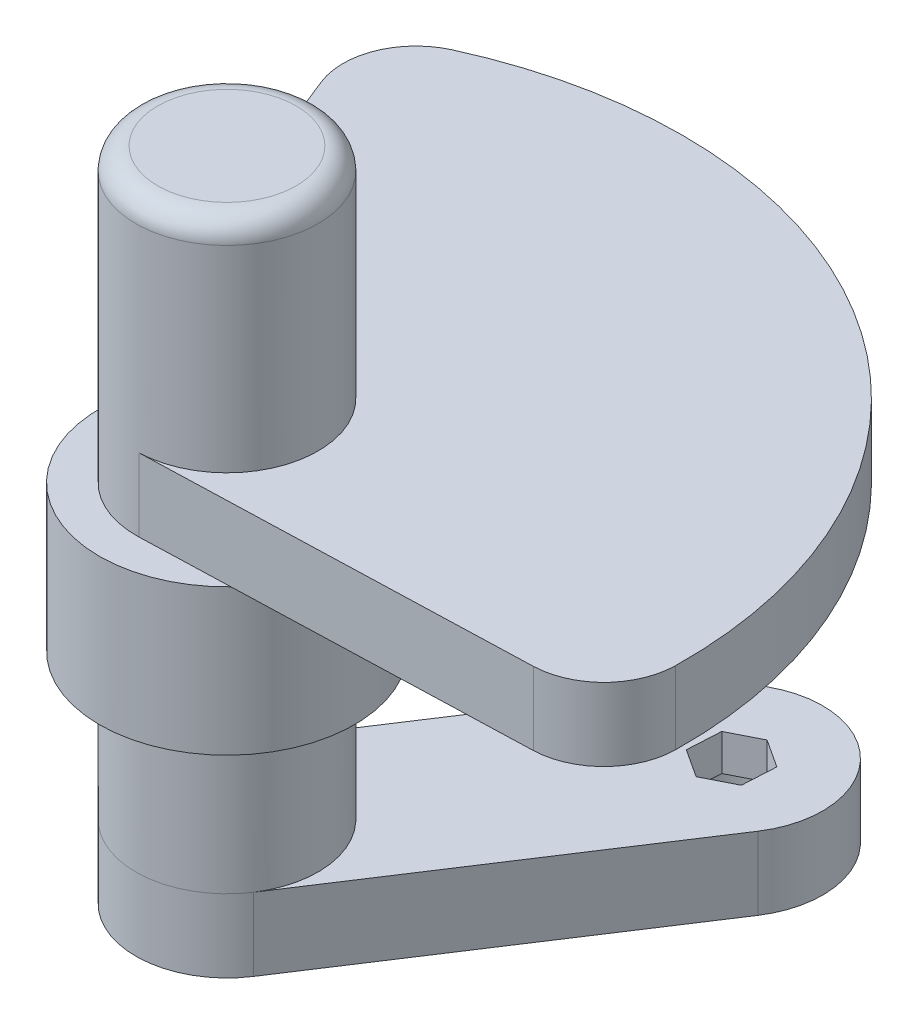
ISO-10303-21;
HEADER;
FILE_DESCRIPTION(('STEP AP214'),'2;1');
FILE_NAME('part.step','',(''),(''),'','','');
FILE_SCHEMA(('AUTOMOTIVE_DESIGN { 1 0 10303 214 1 1 1 1 }'));
ENDSEC;
DATA;
#1=APPLICATION_CONTEXT('core data for automotive mechanical design processes');
#2=APPLICATION_PROTOCOL_DEFINITION('international standard','automotive_design',2000,#1);
#3=PRODUCT_CONTEXT('',#1,'mechanical');
#4=PRODUCT('Part','Part','',(#3));
#5=PRODUCT_RELATED_PRODUCT_CATEGORY('part','',(#4));
#6=PRODUCT_DEFINITION_FORMATION('','',#4);
#7=PRODUCT_DEFINITION_CONTEXT('part definition',#1,'design');
#8=PRODUCT_DEFINITION('design','',#6,#7);
#9=PRODUCT_DEFINITION_SHAPE('','',#8);
#10=(LENGTH_UNIT() NAMED_UNIT(*) SI_UNIT(.MILLI.,.METRE.));
#11=(NAMED_UNIT(*) PLANE_ANGLE_UNIT() SI_UNIT($,.RADIAN.));
#12=(NAMED_UNIT(*) SI_UNIT($,.STERADIAN.) SOLID_ANGLE_UNIT());
#13=UNCERTAINTY_MEASURE_WITH_UNIT(LENGTH_MEASURE(1.E-05),#10,'distance_accuracy_value','');
#14=(GEOMETRIC_REPRESENTATION_CONTEXT(3) GLOBAL_UNCERTAINTY_ASSIGNED_CONTEXT((#13)) GLOBAL_UNIT_ASSIGNED_CONTEXT((#10,
#11,#12)) REPRESENTATION_CONTEXT('',''));
#15=CARTESIAN_POINT('',(0.,0.,0.));
#16=DIRECTION('',(0.,0.,1.));
#17=DIRECTION('',(1.,0.,0.));
#18=AXIS2_PLACEMENT_3D('',#15,#16,#17);
#19=CARTESIAN_POINT('',(-108.137763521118,-0.826362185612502,67.0627115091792));
#20=DIRECTION('',(0.,1.,0.));
#21=DIRECTION('',(0.546944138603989,0.,-0.837169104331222));
#22=AXIS2_PLACEMENT_3D('',#19,#20,#21);
#23=CYLINDRICAL_SURFACE('',#22,12.5);
#24=CARTESIAN_POINT('',(-108.137763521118,9.1736378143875,67.0627115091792));
#25=DIRECTION('',(0.,-1.,0.));
#26=DIRECTION('',(-0.546944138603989,0.,0.837169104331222));
#27=AXIS2_PLACEMENT_3D('',#24,#25,#26);
#28=CIRCLE('',#27,12.5);
#29=CARTESIAN_POINT('',(-97.6731497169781,9.1736378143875,73.8995132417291));
#30=VERTEX_POINT('',#29);
#31=CARTESIAN_POINT('',(-118.602377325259,9.1736378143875,60.2259097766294));
#32=VERTEX_POINT('',#31);
#33=EDGE_CURVE('P0_E153',#30,#32,#28,.T.);
#34=ORIENTED_EDGE('',*,*,#33,.T.);
#35=DIRECTION('',(0.,1.,0.));
#36=VECTOR('',#35,1.);
#37=CARTESIAN_POINT('',(-118.602377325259,-0.826362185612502,60.2259097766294));
#38=LINE('',#37,#36);
#39=CARTESIAN_POINT('',(-118.602377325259,-0.826362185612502,60.2259097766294));
#40=VERTEX_POINT('',#39);
#41=EDGE_CURVE('P0_E202',#40,#32,#38,.T.);
#42=ORIENTED_EDGE('',*,*,#41,.F.);
#43=CARTESIAN_POINT('',(-108.137763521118,-0.826362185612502,67.0627115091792));
#44=DIRECTION('',(0.,-1.,0.));
#45=DIRECTION('',(-0.546944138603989,0.,0.837169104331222));
#46=AXIS2_PLACEMENT_3D('',#43,#44,#45);
#47=CIRCLE('',#46,12.5);
#48=CARTESIAN_POINT('',(-97.6731497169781,-0.826362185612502,73.8995132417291));
#49=VERTEX_POINT('',#48);
#50=EDGE_CURVE('P0_E176',#49,#40,#47,.T.);
#51=ORIENTED_EDGE('',*,*,#50,.F.);
#52=DIRECTION('',(0.,1.,0.));
#53=VECTOR('',#52,1.);
#54=CARTESIAN_POINT('',(-97.6731497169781,-0.826362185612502,73.8995132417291));
#55=LINE('',#54,#53);
#56=EDGE_CURVE('P0_E186',#49,#30,#55,.T.);
#57=ORIENTED_EDGE('',*,*,#56,.T.);
#58=EDGE_LOOP('',(#34,#42,#51,#57));
#59=FACE_BOUND('',#58,.T.);
#60=ADVANCED_FACE('P0_F16',(#59),#23,.T.);
#61=CARTESIAN_POINT('',(-118.602377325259,-0.826362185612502,60.2259097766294));
#62=DIRECTION('',(0.837169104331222,0.,0.546944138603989));
#63=DIRECTION('',(-0.546944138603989,0.,0.837169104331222));
#64=AXIS2_PLACEMENT_3D('',#61,#62,#63);
#65=PLANE('',#64);
#66=DIRECTION('',(0.546944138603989,0.,-0.837169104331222));
#67=VECTOR('',#66,1.);
#68=CARTESIAN_POINT('',(-118.602377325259,9.1736378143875,60.2259097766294));
#69=LINE('',#68,#67);
#70=CARTESIAN_POINT('',(-91.2551703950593,9.1736378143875,18.3674545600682));
#71=VERTEX_POINT('',#70);
#72=EDGE_CURVE('P0_E189',#32,#71,#69,.T.);
#73=ORIENTED_EDGE('',*,*,#72,.T.);
#74=DIRECTION('',(0.,1.,0.));
#75=VECTOR('',#74,1.);
#76=CARTESIAN_POINT('',(-91.2551703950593,-0.826362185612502,18.3674545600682));
#77=LINE('',#76,#75);
#78=CARTESIAN_POINT('',(-91.2551703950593,-0.826362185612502,18.3674545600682));
#79=VERTEX_POINT('',#78);
#80=EDGE_CURVE('P0_E199',#79,#71,#77,.T.);
#81=ORIENTED_EDGE('',*,*,#80,.F.);
#82=DIRECTION('',(0.546944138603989,0.,-0.837169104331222));
#83=VECTOR('',#82,1.);
#84=CARTESIAN_POINT('',(-118.602377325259,-0.826362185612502,60.2259097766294));
#85=LINE('',#84,#83);
#86=EDGE_CURVE('P0_E179',#40,#79,#85,.T.);
#87=ORIENTED_EDGE('',*,*,#86,.F.);
#88=ORIENTED_EDGE('',*,*,#41,.T.);
#89=EDGE_LOOP('',(#73,#81,#87,#88));
#90=FACE_BOUND('',#89,.T.);
#91=ADVANCED_FACE('P0_F250',(#90),#65,.F.);
#92=CARTESIAN_POINT('',(-80.790556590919,-0.826362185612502,25.2042562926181));
#93=DIRECTION('',(0.,1.,0.));
#94=DIRECTION('',(0.546944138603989,0.,-0.837169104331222));
#95=AXIS2_PLACEMENT_3D('',#92,#93,#94);
#96=CYLINDRICAL_SURFACE('',#95,12.5);
#97=CARTESIAN_POINT('',(-80.790556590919,9.1736378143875,25.2042562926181));
#98=DIRECTION('',(0.,-1.,0.));
#99=DIRECTION('',(-0.546944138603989,0.,0.837169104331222));
#100=AXIS2_PLACEMENT_3D('',#97,#98,#99);
#101=CIRCLE('',#100,12.5);
#102=CARTESIAN_POINT('',(-70.3259427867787,9.1736378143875,32.0410580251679));
#103=VERTEX_POINT('',#102);
#104=EDGE_CURVE('P0_E191',#71,#103,#101,.T.);
#105=ORIENTED_EDGE('',*,*,#104,.T.);
#106=DIRECTION('',(0.,1.,0.));
#107=VECTOR('',#106,1.);
#108=CARTESIAN_POINT('',(-70.3259427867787,-0.826362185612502,32.0410580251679));
#109=LINE('',#108,#107);
#110=CARTESIAN_POINT('',(-70.3259427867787,-0.826362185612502,32.0410580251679));
#111=VERTEX_POINT('',#110);
#112=EDGE_CURVE('P0_E196',#111,#103,#109,.T.);
#113=ORIENTED_EDGE('',*,*,#112,.F.);
#114=CARTESIAN_POINT('',(-80.790556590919,-0.826362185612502,25.2042562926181));
#115=DIRECTION('',(0.,-1.,0.));
#116=DIRECTION('',(-0.546944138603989,0.,0.837169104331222));
#117=AXIS2_PLACEMENT_3D('',#114,#115,#116);
#118=CIRCLE('',#117,12.5);
#119=EDGE_CURVE('P0_E182',#79,#111,#118,.T.);
#120=ORIENTED_EDGE('',*,*,#119,.F.);
#121=ORIENTED_EDGE('',*,*,#80,.T.);
#122=EDGE_LOOP('',(#105,#113,#120,#121));
#123=FACE_BOUND('',#122,.T.);
#124=ADVANCED_FACE('P0_F255',(#123),#96,.T.);
#125=CARTESIAN_POINT('',(-97.6731497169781,-0.826362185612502,73.8995132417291));
#126=DIRECTION('',(-0.837169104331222,0.,-0.546944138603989));
#127=DIRECTION('',(0.546944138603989,0.,-0.837169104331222));
#128=AXIS2_PLACEMENT_3D('',#125,#126,#127);
#129=PLANE('',#128);
#130=DIRECTION('',(-0.546944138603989,0.,0.837169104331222));
#131=VECTOR('',#130,1.);
#132=CARTESIAN_POINT('',(-97.6731497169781,9.1736378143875,73.8995132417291));
#133=LINE('',#132,#131);
#134=EDGE_CURVE('P0_E180',#103,#30,#133,.T.);
#135=ORIENTED_EDGE('',*,*,#134,.T.);
#136=ORIENTED_EDGE('',*,*,#56,.F.);
#137=DIRECTION('',(-0.546944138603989,0.,0.837169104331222));
#138=VECTOR('',#137,1.);
#139=CARTESIAN_POINT('',(-97.6731497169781,-0.826362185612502,73.8995132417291));
#140=LINE('',#139,#138);
#141=EDGE_CURVE('P0_E184',#111,#49,#140,.T.);
#142=ORIENTED_EDGE('',*,*,#141,.F.);
#143=ORIENTED_EDGE('',*,*,#112,.T.);
#144=EDGE_LOOP('',(#135,#136,#142,#143));
#145=FACE_BOUND('',#144,.T.);
#146=ADVANCED_FACE('P0_F271',(#145),#129,.F.);
#147=CARTESIAN_POINT('',(-108.137763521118,-0.826362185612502,67.0627115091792));
#148=DIRECTION('',(0.,-1.,0.));
#149=DIRECTION('',(-0.546944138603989,0.,0.837169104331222));
#150=AXIS2_PLACEMENT_3D('',#147,#148,#149);
#151=PLANE('',#150);
#152=CARTESIAN_POINT('',(-80.790556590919,-0.826362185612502,25.2042562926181));
#153=DIRECTION('',(0.,1.,0.));
#154=DIRECTION('',(0.546944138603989,0.,-0.837169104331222));
#155=AXIS2_PLACEMENT_3D('',#152,#153,#154);
#156=CIRCLE('',#155,8.);
#157=CARTESIAN_POINT('',(-76.4150034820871,-0.826362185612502,18.5069034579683));
#158=VERTEX_POINT('',#157);
#159=EDGE_CURVE('P0_E125',#158,#158,#156,.T.);
#160=ORIENTED_EDGE('',*,*,#159,.T.);
#161=EDGE_LOOP('',(#160));
#162=FACE_BOUND('',#161,.T.);
#163=CARTESIAN_POINT('',(-103.215266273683,-0.826362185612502,59.5281895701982));
#164=DIRECTION('',(0.,-1.,0.));
#165=DIRECTION('',(-0.546944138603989,0.,0.837169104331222));
#166=AXIS2_PLACEMENT_3D('',#163,#164,#165);
#167=CIRCLE('',#166,2.85);
#168=CARTESIAN_POINT('',(-104.774057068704,-0.826362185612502,61.9141215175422));
#169=VERTEX_POINT('',#168);
#170=EDGE_CURVE('P0_E154',#169,#169,#167,.T.);
#171=ORIENTED_EDGE('',*,*,#170,.F.);
#172=EDGE_LOOP('',(#171));
#173=FACE_BOUND('',#172,.T.);
#174=CARTESIAN_POINT('',(-115.672285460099,-0.826362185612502,62.1402142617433));
#175=DIRECTION('',(0.,-1.,0.));
#176=DIRECTION('',(-0.546944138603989,0.,0.837169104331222));
#177=AXIS2_PLACEMENT_3D('',#174,#175,#176);
#178=CIRCLE('',#177,2.85);
#179=CARTESIAN_POINT('',(-117.231076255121,-0.826362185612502,64.5261462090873));
#180=VERTEX_POINT('',#179);
#181=EDGE_CURVE('P0_E160',#180,#180,#178,.T.);
#182=ORIENTED_EDGE('',*,*,#181,.F.);
#183=EDGE_LOOP('',(#182));
#184=FACE_BOUND('',#183,.T.);
#185=CARTESIAN_POINT('',(-113.060260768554,-0.826362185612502,74.5972334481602));
#186=DIRECTION('',(0.,-1.,0.));
#187=DIRECTION('',(-0.546944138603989,0.,0.837169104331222));
#188=AXIS2_PLACEMENT_3D('',#185,#186,#187);
#189=CIRCLE('',#188,2.85);
#190=CARTESIAN_POINT('',(-114.619051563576,-0.826362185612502,76.9831653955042));
#191=VERTEX_POINT('',#190);
#192=EDGE_CURVE('P0_E166',#191,#191,#189,.T.);
#193=ORIENTED_EDGE('',*,*,#192,.F.);
#194=EDGE_LOOP('',(#193));
#195=FACE_BOUND('',#194,.T.);
#196=CARTESIAN_POINT('',(-100.603241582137,-0.826362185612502,71.9852087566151));
#197=DIRECTION('',(0.,-1.,0.));
#198=DIRECTION('',(-0.546944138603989,0.,0.837169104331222));
#199=AXIS2_PLACEMENT_3D('',#196,#197,#198);
#200=CIRCLE('',#199,2.85);
#201=CARTESIAN_POINT('',(-102.162032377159,-0.826362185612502,74.3711407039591));
#202=VERTEX_POINT('',#201);
#203=EDGE_CURVE('P0_E172',#202,#202,#200,.T.);
#204=ORIENTED_EDGE('',*,*,#203,.F.);
#205=EDGE_LOOP('',(#204));
#206=FACE_BOUND('',#205,.T.);
#207=ORIENTED_EDGE('',*,*,#50,.T.);
#208=ORIENTED_EDGE('',*,*,#86,.T.);
#209=ORIENTED_EDGE('',*,*,#119,.T.);
#210=ORIENTED_EDGE('',*,*,#141,.T.);
#211=EDGE_LOOP('',(#207,#208,#209,#210));
#212=FACE_BOUND('',#211,.T.);
#213=ADVANCED_FACE('P0_F267',(#162,#173,#184,#195,#206,#212),#151,.T.);
#214=CARTESIAN_POINT('',(-108.137763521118,9.1736378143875,67.0627115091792));
#215=DIRECTION('',(0.,-1.,0.));
#216=DIRECTION('',(-0.546944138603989,0.,0.837169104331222));
#217=AXIS2_PLACEMENT_3D('',#214,#215,#216);
#218=PLANE('',#217);
#219=DIRECTION('',(-0.0550829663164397,0.,0.998481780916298));
#220=VECTOR('',#219,1.);
#221=CARTESIAN_POINT('',(-84.6572750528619,9.1736378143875,22.6780295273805));
#222=LINE('',#221,#220);
#223=CARTESIAN_POINT('',(-84.6572750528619,9.1736378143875,22.6780295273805));
#224=VERTEX_POINT('',#223);
#225=CARTESIAN_POINT('',(-84.9116923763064,9.1736378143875,27.2898193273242));
#226=VERTEX_POINT('',#225);
#227=EDGE_CURVE('P0_E104',#224,#226,#222,.T.);
#228=ORIENTED_EDGE('',*,*,#227,.F.);
#229=DIRECTION('',(-0.892252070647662,0.,0.45153764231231));
#230=VECTOR('',#229,1.);
#231=CARTESIAN_POINT('',(-80.5361392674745,9.1736378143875,20.5924664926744));
#232=LINE('',#231,#230);
#233=CARTESIAN_POINT('',(-80.5361392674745,9.1736378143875,20.5924664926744));
#234=VERTEX_POINT('',#233);
#235=EDGE_CURVE('P0_E30',#234,#224,#232,.T.);
#236=ORIENTED_EDGE('',*,*,#235,.F.);
#237=DIRECTION('',(-0.837169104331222,0.,-0.546944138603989));
#238=VECTOR('',#237,1.);
#239=CARTESIAN_POINT('',(-76.6694208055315,9.1736378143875,23.118693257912));
#240=LINE('',#239,#238);
#241=CARTESIAN_POINT('',(-76.6694208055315,9.1736378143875,23.118693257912));
#242=VERTEX_POINT('',#241);
#243=EDGE_CURVE('P0_E120',#242,#234,#240,.T.);
#244=ORIENTED_EDGE('',*,*,#243,.F.);
#245=DIRECTION('',(0.0550829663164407,0.,-0.998481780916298));
#246=VECTOR('',#245,1.);
#247=CARTESIAN_POINT('',(-76.923838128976,9.1736378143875,27.7304830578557));
#248=LINE('',#247,#246);
#249=CARTESIAN_POINT('',(-76.923838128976,9.1736378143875,27.7304830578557));
#250=VERTEX_POINT('',#249);
#251=EDGE_CURVE('P0_E114',#250,#242,#248,.T.);
#252=ORIENTED_EDGE('',*,*,#251,.F.);
#253=DIRECTION('',(0.892252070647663,0.,-0.451537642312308));
#254=VECTOR('',#253,1.);
#255=CARTESIAN_POINT('',(-81.0449739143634,9.1736378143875,29.8160460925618));
#256=LINE('',#255,#254);
#257=CARTESIAN_POINT('',(-81.0449739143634,9.1736378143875,29.8160460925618));
#258=VERTEX_POINT('',#257);
#259=EDGE_CURVE('P0_E112',#258,#250,#256,.T.);
#260=ORIENTED_EDGE('',*,*,#259,.F.);
#261=DIRECTION('',(0.837169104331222,0.,0.546944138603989));
#262=VECTOR('',#261,1.);
#263=CARTESIAN_POINT('',(-84.9116923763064,9.1736378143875,27.2898193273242));
#264=LINE('',#263,#262);
#265=EDGE_CURVE('P0_E95',#226,#258,#264,.T.);
#266=ORIENTED_EDGE('',*,*,#265,.F.);
#267=EDGE_LOOP('',(#228,#236,#244,#252,#260,#266));
#268=FACE_BOUND('',#267,.T.);
#269=CARTESIAN_POINT('',(-103.215266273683,9.1736378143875,59.5281895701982));
#270=DIRECTION('',(0.,-1.,0.));
#271=DIRECTION('',(-0.546944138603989,0.,0.837169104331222));
#272=AXIS2_PLACEMENT_3D('',#269,#270,#271);
#273=CIRCLE('',#272,2.);
#274=CARTESIAN_POINT('',(-104.30915455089,9.1736378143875,61.2025277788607));
#275=VERTEX_POINT('',#274);
#276=EDGE_CURVE('P0_E138',#275,#275,#273,.T.);
#277=ORIENTED_EDGE('',*,*,#276,.T.);
#278=EDGE_LOOP('',(#277));
#279=FACE_BOUND('',#278,.T.);
#280=CARTESIAN_POINT('',(-115.672285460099,9.1736378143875,62.1402142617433));
#281=DIRECTION('',(0.,-1.,0.));
#282=DIRECTION('',(-0.546944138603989,0.,0.837169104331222));
#283=AXIS2_PLACEMENT_3D('',#280,#281,#282);
#284=CIRCLE('',#283,2.);
#285=CARTESIAN_POINT('',(-116.766173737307,9.1736378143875,63.8145524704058));
#286=VERTEX_POINT('',#285);
#287=EDGE_CURVE('P0_E142',#286,#286,#284,.T.);
#288=ORIENTED_EDGE('',*,*,#287,.T.);
#289=EDGE_LOOP('',(#288));
#290=FACE_BOUND('',#289,.T.);
#291=CARTESIAN_POINT('',(-113.060260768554,9.1736378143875,74.5972334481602));
#292=DIRECTION('',(0.,-1.,0.));
#293=DIRECTION('',(-0.546944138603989,0.,0.837169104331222));
#294=AXIS2_PLACEMENT_3D('',#291,#292,#293);
#295=CIRCLE('',#294,2.);
#296=CARTESIAN_POINT('',(-114.154149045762,9.1736378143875,76.2715716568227));
#297=VERTEX_POINT('',#296);
#298=EDGE_CURVE('P0_E145',#297,#297,#295,.T.);
#299=ORIENTED_EDGE('',*,*,#298,.T.);
#300=EDGE_LOOP('',(#299));
#301=FACE_BOUND('',#300,.T.);
#302=CARTESIAN_POINT('',(-100.603241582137,9.1736378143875,71.9852087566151));
#303=DIRECTION('',(0.,-1.,0.));
#304=DIRECTION('',(-0.546944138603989,0.,0.837169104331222));
#305=AXIS2_PLACEMENT_3D('',#302,#303,#304);
#306=CIRCLE('',#305,2.);
#307=CARTESIAN_POINT('',(-101.697129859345,9.1736378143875,73.6595469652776));
#308=VERTEX_POINT('',#307);
#309=EDGE_CURVE('P0_E135',#308,#308,#306,.T.);
#310=ORIENTED_EDGE('',*,*,#309,.T.);
#311=EDGE_LOOP('',(#310));
#312=FACE_BOUND('',#311,.T.);
#313=ORIENTED_EDGE('',*,*,#33,.F.);
#314=ORIENTED_EDGE('',*,*,#134,.F.);
#315=ORIENTED_EDGE('',*,*,#104,.F.);
#316=ORIENTED_EDGE('',*,*,#72,.F.);
#317=EDGE_LOOP('',(#313,#314,#315,#316));
#318=FACE_BOUND('',#317,.T.);
#319=ADVANCED_FACE('P0_F108',(#268,#279,#290,#301,#312,#318),#218,.F.);
#320=CARTESIAN_POINT('',(-100.603241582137,2.1736378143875,71.9852087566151));
#321=DIRECTION('',(0.,-1.,0.));
#322=DIRECTION('',(-0.546944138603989,0.,0.837169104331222));
#323=AXIS2_PLACEMENT_3D('',#320,#321,#322);
#324=CYLINDRICAL_SURFACE('',#323,2.85);
#325=CARTESIAN_POINT('',(-100.603241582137,2.1736378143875,71.9852087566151));
#326=DIRECTION('',(0.,-1.,0.));
#327=DIRECTION('',(-0.546944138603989,0.,0.837169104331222));
#328=AXIS2_PLACEMENT_3D('',#325,#326,#327);
#329=CIRCLE('',#328,2.85);
#330=CARTESIAN_POINT('',(-102.162032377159,2.1736378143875,74.3711407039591));
#331=VERTEX_POINT('',#330);
#332=EDGE_CURVE('P0_E169',#331,#331,#329,.T.);
#333=ORIENTED_EDGE('',*,*,#332,.F.);
#334=EDGE_LOOP('',(#333));
#335=FACE_BOUND('',#334,.T.);
#336=ORIENTED_EDGE('',*,*,#203,.T.);
#337=EDGE_LOOP('',(#336));
#338=FACE_BOUND('',#337,.T.);
#339=ADVANCED_FACE('P0_F282',(#335,#338),#324,.F.);
#340=CARTESIAN_POINT('',(-100.603241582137,2.1736378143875,71.9852087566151));
#341=DIRECTION('',(0.,-1.,0.));
#342=DIRECTION('',(-0.546944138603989,0.,0.837169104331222));
#343=AXIS2_PLACEMENT_3D('',#340,#341,#342);
#344=PLANE('',#343);
#345=CARTESIAN_POINT('',(-100.603241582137,2.1736378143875,71.9852087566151));
#346=DIRECTION('',(0.,-1.,0.));
#347=DIRECTION('',(-0.546944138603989,0.,0.837169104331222));
#348=AXIS2_PLACEMENT_3D('',#345,#346,#347);
#349=CIRCLE('',#348,2.);
#350=CARTESIAN_POINT('',(-101.697129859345,2.1736378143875,73.6595469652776));
#351=VERTEX_POINT('',#350);
#352=EDGE_CURVE('P0_E175',#351,#351,#349,.T.);
#353=ORIENTED_EDGE('',*,*,#352,.F.);
#354=EDGE_LOOP('',(#353));
#355=FACE_BOUND('',#354,.T.);
#356=ORIENTED_EDGE('',*,*,#332,.T.);
#357=EDGE_LOOP('',(#356));
#358=FACE_BOUND('',#357,.T.);
#359=ADVANCED_FACE('P0_F288',(#355,#358),#344,.T.);
#360=CARTESIAN_POINT('',(-113.060260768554,2.1736378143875,74.5972334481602));
#361=DIRECTION('',(0.,-1.,0.));
#362=DIRECTION('',(-0.546944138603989,0.,0.837169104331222));
#363=AXIS2_PLACEMENT_3D('',#360,#361,#362);
#364=CYLINDRICAL_SURFACE('',#363,2.85);
#365=CARTESIAN_POINT('',(-113.060260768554,2.1736378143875,74.5972334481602));
#366=DIRECTION('',(0.,-1.,0.));
#367=DIRECTION('',(-0.546944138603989,0.,0.837169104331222));
#368=AXIS2_PLACEMENT_3D('',#365,#366,#367);
#369=CIRCLE('',#368,2.85);
#370=CARTESIAN_POINT('',(-114.619051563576,2.1736378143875,76.9831653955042));
#371=VERTEX_POINT('',#370);
#372=EDGE_CURVE('P0_E163',#371,#371,#369,.T.);
#373=ORIENTED_EDGE('',*,*,#372,.F.);
#374=EDGE_LOOP('',(#373));
#375=FACE_BOUND('',#374,.T.);
#376=ORIENTED_EDGE('',*,*,#192,.T.);
#377=EDGE_LOOP('',(#376));
#378=FACE_BOUND('',#377,.T.);
#379=ADVANCED_FACE('P0_F292',(#375,#378),#364,.F.);
#380=CARTESIAN_POINT('',(-113.060260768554,2.1736378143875,74.5972334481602));
#381=DIRECTION('',(0.,-1.,0.));
#382=DIRECTION('',(-0.546944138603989,0.,0.837169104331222));
#383=AXIS2_PLACEMENT_3D('',#380,#381,#382);
#384=PLANE('',#383);
#385=CARTESIAN_POINT('',(-113.060260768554,2.1736378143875,74.5972334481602));
#386=DIRECTION('',(0.,-1.,0.));
#387=DIRECTION('',(-0.546944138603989,0.,0.837169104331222));
#388=AXIS2_PLACEMENT_3D('',#385,#386,#387);
#389=CIRCLE('',#388,2.);
#390=CARTESIAN_POINT('',(-114.154149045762,2.1736378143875,76.2715716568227));
#391=VERTEX_POINT('',#390);
#392=EDGE_CURVE('P0_E211',#391,#391,#389,.T.);
#393=ORIENTED_EDGE('',*,*,#392,.F.);
#394=EDGE_LOOP('',(#393));
#395=FACE_BOUND('',#394,.T.);
#396=ORIENTED_EDGE('',*,*,#372,.T.);
#397=EDGE_LOOP('',(#396));
#398=FACE_BOUND('',#397,.T.);
#399=ADVANCED_FACE('P0_F296',(#395,#398),#384,.T.);
#400=CARTESIAN_POINT('',(-115.672285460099,2.1736378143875,62.1402142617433));
#401=DIRECTION('',(0.,-1.,0.));
#402=DIRECTION('',(-0.546944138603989,0.,0.837169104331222));
#403=AXIS2_PLACEMENT_3D('',#400,#401,#402);
#404=CYLINDRICAL_SURFACE('',#403,2.85);
#405=CARTESIAN_POINT('',(-115.672285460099,2.1736378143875,62.1402142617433));
#406=DIRECTION('',(0.,-1.,0.));
#407=DIRECTION('',(-0.546944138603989,0.,0.837169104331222));
#408=AXIS2_PLACEMENT_3D('',#405,#406,#407);
#409=CIRCLE('',#408,2.85);
#410=CARTESIAN_POINT('',(-117.231076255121,2.1736378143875,64.5261462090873));
#411=VERTEX_POINT('',#410);
#412=EDGE_CURVE('P0_E157',#411,#411,#409,.T.);
#413=ORIENTED_EDGE('',*,*,#412,.F.);
#414=EDGE_LOOP('',(#413));
#415=FACE_BOUND('',#414,.T.);
#416=ORIENTED_EDGE('',*,*,#181,.T.);
#417=EDGE_LOOP('',(#416));
#418=FACE_BOUND('',#417,.T.);
#419=ADVANCED_FACE('P0_F300',(#415,#418),#404,.F.);
#420=CARTESIAN_POINT('',(-115.672285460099,2.1736378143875,62.1402142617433));
#421=DIRECTION('',(0.,-1.,0.));
#422=DIRECTION('',(-0.546944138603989,0.,0.837169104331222));
#423=AXIS2_PLACEMENT_3D('',#420,#421,#422);
#424=PLANE('',#423);
#425=CARTESIAN_POINT('',(-115.672285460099,2.1736378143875,62.1402142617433));
#426=DIRECTION('',(0.,-1.,0.));
#427=DIRECTION('',(-0.546944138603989,0.,0.837169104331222));
#428=AXIS2_PLACEMENT_3D('',#425,#426,#427);
#429=CIRCLE('',#428,2.);
#430=CARTESIAN_POINT('',(-116.766173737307,2.1736378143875,63.8145524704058));
#431=VERTEX_POINT('',#430);
#432=EDGE_CURVE('P0_E208',#431,#431,#429,.T.);
#433=ORIENTED_EDGE('',*,*,#432,.F.);
#434=EDGE_LOOP('',(#433));
#435=FACE_BOUND('',#434,.T.);
#436=ORIENTED_EDGE('',*,*,#412,.T.);
#437=EDGE_LOOP('',(#436));
#438=FACE_BOUND('',#437,.T.);
#439=ADVANCED_FACE('P0_F304',(#435,#438),#424,.T.);
#440=CARTESIAN_POINT('',(-103.215266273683,2.1736378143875,59.5281895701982));
#441=DIRECTION('',(0.,-1.,0.));
#442=DIRECTION('',(-0.546944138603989,0.,0.837169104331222));
#443=AXIS2_PLACEMENT_3D('',#440,#441,#442);
#444=CYLINDRICAL_SURFACE('',#443,2.85);
#445=CARTESIAN_POINT('',(-103.215266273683,2.1736378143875,59.5281895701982));
#446=DIRECTION('',(0.,-1.,0.));
#447=DIRECTION('',(-0.546944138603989,0.,0.837169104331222));
#448=AXIS2_PLACEMENT_3D('',#445,#446,#447);
#449=CIRCLE('',#448,2.85);
#450=CARTESIAN_POINT('',(-104.774057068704,2.1736378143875,61.9141215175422));
#451=VERTEX_POINT('',#450);
#452=EDGE_CURVE('P0_E150',#451,#451,#449,.T.);
#453=ORIENTED_EDGE('',*,*,#452,.F.);
#454=EDGE_LOOP('',(#453));
#455=FACE_BOUND('',#454,.T.);
#456=ORIENTED_EDGE('',*,*,#170,.T.);
#457=EDGE_LOOP('',(#456));
#458=FACE_BOUND('',#457,.T.);
#459=ADVANCED_FACE('P0_F308',(#455,#458),#444,.F.);
#460=CARTESIAN_POINT('',(-103.215266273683,2.1736378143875,59.5281895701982));
#461=DIRECTION('',(0.,-1.,0.));
#462=DIRECTION('',(-0.546944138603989,0.,0.837169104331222));
#463=AXIS2_PLACEMENT_3D('',#460,#461,#462);
#464=PLANE('',#463);
#465=CARTESIAN_POINT('',(-103.215266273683,2.1736378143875,59.5281895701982));
#466=DIRECTION('',(0.,-1.,0.));
#467=DIRECTION('',(-0.546944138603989,0.,0.837169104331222));
#468=AXIS2_PLACEMENT_3D('',#465,#466,#467);
#469=CIRCLE('',#468,2.);
#470=CARTESIAN_POINT('',(-104.30915455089,2.1736378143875,61.2025277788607));
#471=VERTEX_POINT('',#470);
#472=EDGE_CURVE('P0_E141',#471,#471,#469,.T.);
#473=ORIENTED_EDGE('',*,*,#472,.F.);
#474=EDGE_LOOP('',(#473));
#475=FACE_BOUND('',#474,.T.);
#476=ORIENTED_EDGE('',*,*,#452,.T.);
#477=EDGE_LOOP('',(#476));
#478=FACE_BOUND('',#477,.T.);
#479=ADVANCED_FACE('P0_F312',(#475,#478),#464,.T.);
#480=CARTESIAN_POINT('',(-103.215266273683,9.1736378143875,59.5281895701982));
#481=DIRECTION('',(0.,-1.,0.));
#482=DIRECTION('',(-0.546944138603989,0.,0.837169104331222));
#483=AXIS2_PLACEMENT_3D('',#480,#481,#482);
#484=CYLINDRICAL_SURFACE('',#483,2.);
#485=ORIENTED_EDGE('',*,*,#472,.T.);
#486=EDGE_LOOP('',(#485));
#487=FACE_BOUND('',#486,.T.);
#488=ORIENTED_EDGE('',*,*,#276,.F.);
#489=EDGE_LOOP('',(#488));
#490=FACE_BOUND('',#489,.T.);
#491=ADVANCED_FACE('P0_F316',(#487,#490),#484,.F.);
#492=CARTESIAN_POINT('',(-115.672285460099,9.1736378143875,62.1402142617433));
#493=DIRECTION('',(0.,-1.,0.));
#494=DIRECTION('',(-0.546944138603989,0.,0.837169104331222));
#495=AXIS2_PLACEMENT_3D('',#492,#493,#494);
#496=CYLINDRICAL_SURFACE('',#495,2.);
#497=ORIENTED_EDGE('',*,*,#432,.T.);
#498=EDGE_LOOP('',(#497));
#499=FACE_BOUND('',#498,.T.);
#500=ORIENTED_EDGE('',*,*,#287,.F.);
#501=EDGE_LOOP('',(#500));
#502=FACE_BOUND('',#501,.T.);
#503=ADVANCED_FACE('P0_F325',(#499,#502),#496,.F.);
#504=CARTESIAN_POINT('',(-113.060260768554,9.1736378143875,74.5972334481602));
#505=DIRECTION('',(0.,-1.,0.));
#506=DIRECTION('',(-0.546944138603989,0.,0.837169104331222));
#507=AXIS2_PLACEMENT_3D('',#504,#505,#506);
#508=CYLINDRICAL_SURFACE('',#507,2.);
#509=ORIENTED_EDGE('',*,*,#392,.T.);
#510=EDGE_LOOP('',(#509));
#511=FACE_BOUND('',#510,.T.);
#512=ORIENTED_EDGE('',*,*,#298,.F.);
#513=EDGE_LOOP('',(#512));
#514=FACE_BOUND('',#513,.T.);
#515=ADVANCED_FACE('P0_F321',(#511,#514),#508,.F.);
#516=CARTESIAN_POINT('',(-100.603241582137,9.1736378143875,71.9852087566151));
#517=DIRECTION('',(0.,-1.,0.));
#518=DIRECTION('',(-0.546944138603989,0.,0.837169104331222));
#519=AXIS2_PLACEMENT_3D('',#516,#517,#518);
#520=CYLINDRICAL_SURFACE('',#519,2.);
#521=ORIENTED_EDGE('',*,*,#352,.T.);
#522=EDGE_LOOP('',(#521));
#523=FACE_BOUND('',#522,.T.);
#524=ORIENTED_EDGE('',*,*,#309,.F.);
#525=EDGE_LOOP('',(#524));
#526=FACE_BOUND('',#525,.T.);
#527=ADVANCED_FACE('P0_F318',(#523,#526),#520,.F.);
#528=CARTESIAN_POINT('',(-80.790556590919,4.1736378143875,25.2042562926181));
#529=DIRECTION('',(0.,-1.,0.));
#530=DIRECTION('',(-0.546944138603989,0.,0.837169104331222));
#531=AXIS2_PLACEMENT_3D('',#528,#529,#530);
#532=CYLINDRICAL_SURFACE('',#531,8.);
#533=CARTESIAN_POINT('',(-80.790556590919,4.1736378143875,25.2042562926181));
#534=DIRECTION('',(0.,1.,0.));
#535=DIRECTION('',(0.546944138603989,0.,-0.837169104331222));
#536=AXIS2_PLACEMENT_3D('',#533,#534,#535);
#537=CIRCLE('',#536,8.);
#538=CARTESIAN_POINT('',(-76.4150034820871,4.1736378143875,18.5069034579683));
#539=VERTEX_POINT('',#538);
#540=EDGE_CURVE('P0_E132',#539,#539,#537,.T.);
#541=ORIENTED_EDGE('',*,*,#540,.T.);
#542=EDGE_LOOP('',(#541));
#543=FACE_BOUND('',#542,.T.);
#544=ORIENTED_EDGE('',*,*,#159,.F.);
#545=EDGE_LOOP('',(#544));
#546=FACE_BOUND('',#545,.T.);
#547=ADVANCED_FACE('P0_F246',(#543,#546),#532,.F.);
#548=CARTESIAN_POINT('',(-80.790556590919,4.1736378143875,25.2042562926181));
#549=DIRECTION('',(0.,1.,0.));
#550=DIRECTION('',(0.546944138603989,0.,-0.837169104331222));
#551=AXIS2_PLACEMENT_3D('',#548,#549,#550);
#552=PLANE('',#551);
#553=DIRECTION('',(-0.837169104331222,0.,-0.546944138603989));
#554=VECTOR('',#553,1.);
#555=CARTESIAN_POINT('',(-78.602780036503,4.1736378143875,21.8555798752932));
#556=LINE('',#555,#554);
#557=CARTESIAN_POINT('',(-76.6694208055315,4.1736378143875,23.118693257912));
#558=VERTEX_POINT('',#557);
#559=CARTESIAN_POINT('',(-80.5361392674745,4.1736378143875,20.5924664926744));
#560=VERTEX_POINT('',#559);
#561=EDGE_CURVE('P0_E23',#558,#560,#556,.T.);
#562=ORIENTED_EDGE('',*,*,#561,.T.);
#563=DIRECTION('',(-0.892252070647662,0.,0.45153764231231));
#564=VECTOR('',#563,1.);
#565=CARTESIAN_POINT('',(-82.5967071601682,4.1736378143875,21.6352480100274));
#566=LINE('',#565,#564);
#567=CARTESIAN_POINT('',(-84.6572750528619,4.1736378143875,22.6780295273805));
#568=VERTEX_POINT('',#567);
#569=EDGE_CURVE('P0_E10',#560,#568,#566,.T.);
#570=ORIENTED_EDGE('',*,*,#569,.T.);
#571=DIRECTION('',(-0.0550829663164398,0.,0.998481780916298));
#572=VECTOR('',#571,1.);
#573=CARTESIAN_POINT('',(-84.7844837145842,4.1736378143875,24.9839244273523));
#574=LINE('',#573,#572);
#575=CARTESIAN_POINT('',(-84.9116923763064,4.1736378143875,27.2898193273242));
#576=VERTEX_POINT('',#575);
#577=EDGE_CURVE('P0_E205',#568,#576,#574,.T.);
#578=ORIENTED_EDGE('',*,*,#577,.T.);
#579=DIRECTION('',(0.837169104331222,0.,0.546944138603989));
#580=VECTOR('',#579,1.);
#581=CARTESIAN_POINT('',(-82.9783331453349,4.1736378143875,28.552932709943));
#582=LINE('',#581,#580);
#583=CARTESIAN_POINT('',(-81.0449739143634,4.1736378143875,29.8160460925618));
#584=VERTEX_POINT('',#583);
#585=EDGE_CURVE('P0_E98',#576,#584,#582,.T.);
#586=ORIENTED_EDGE('',*,*,#585,.T.);
#587=DIRECTION('',(0.892252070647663,0.,-0.451537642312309));
#588=VECTOR('',#587,1.);
#589=CARTESIAN_POINT('',(-78.9844060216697,4.1736378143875,28.7732645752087));
#590=LINE('',#589,#588);
#591=CARTESIAN_POINT('',(-76.923838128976,4.1736378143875,27.7304830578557));
#592=VERTEX_POINT('',#591);
#593=EDGE_CURVE('P0_E218',#584,#592,#590,.T.);
#594=ORIENTED_EDGE('',*,*,#593,.T.);
#595=DIRECTION('',(0.0550829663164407,0.,-0.998481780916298));
#596=VECTOR('',#595,1.);
#597=CARTESIAN_POINT('',(-76.7966294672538,4.1736378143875,25.4245881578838));
#598=LINE('',#597,#596);
#599=EDGE_CURVE('P0_E221',#592,#558,#598,.T.);
#600=ORIENTED_EDGE('',*,*,#599,.T.);
#601=EDGE_LOOP('',(#562,#570,#578,#586,#594,#600));
#602=FACE_BOUND('',#601,.T.);
#603=ORIENTED_EDGE('',*,*,#540,.F.);
#604=EDGE_LOOP('',(#603));
#605=FACE_BOUND('',#604,.T.);
#606=ADVANCED_FACE('P0_F225',(#602,#605),#552,.F.);
#607=CARTESIAN_POINT('',(-80.5361392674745,-0.826362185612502,20.5924664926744));
#608=DIRECTION('',(-0.45153764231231,0.,-0.892252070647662));
#609=DIRECTION('',(0.892252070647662,0.,-0.45153764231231));
#610=AXIS2_PLACEMENT_3D('',#607,#608,#609);
#611=PLANE('',#610);
#612=DIRECTION('',(0.,1.,0.));
#613=VECTOR('',#612,1.);
#614=CARTESIAN_POINT('',(-80.5361392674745,-0.826362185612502,20.5924664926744));
#615=LINE('',#614,#613);
#616=EDGE_CURVE('P0_E123',#560,#234,#615,.T.);
#617=ORIENTED_EDGE('',*,*,#616,.T.);
#618=ORIENTED_EDGE('',*,*,#235,.T.);
#619=DIRECTION('',(0.,1.,0.));
#620=VECTOR('',#619,1.);
#621=CARTESIAN_POINT('',(-84.6572750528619,-0.826362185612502,22.6780295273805));
#622=LINE('',#621,#620);
#623=EDGE_CURVE('P0_E101',#568,#224,#622,.T.);
#624=ORIENTED_EDGE('',*,*,#623,.F.);
#625=ORIENTED_EDGE('',*,*,#569,.F.);
#626=EDGE_LOOP('',(#617,#618,#624,#625));
#627=FACE_BOUND('',#626,.T.);
#628=ADVANCED_FACE('P0_F237',(#627),#611,.F.);
#629=CARTESIAN_POINT('',(-76.6694208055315,-0.826362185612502,23.118693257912));
#630=DIRECTION('',(0.546944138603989,0.,-0.837169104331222));
#631=DIRECTION('',(0.837169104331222,0.,0.546944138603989));
#632=AXIS2_PLACEMENT_3D('',#629,#630,#631);
#633=PLANE('',#632);
#634=DIRECTION('',(0.,1.,0.));
#635=VECTOR('',#634,1.);
#636=CARTESIAN_POINT('',(-76.6694208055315,-0.826362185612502,23.118693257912));
#637=LINE('',#636,#635);
#638=EDGE_CURVE('P0_E126',#558,#242,#637,.T.);
#639=ORIENTED_EDGE('',*,*,#638,.T.);
#640=ORIENTED_EDGE('',*,*,#243,.T.);
#641=ORIENTED_EDGE('',*,*,#616,.F.);
#642=ORIENTED_EDGE('',*,*,#561,.F.);
#643=EDGE_LOOP('',(#639,#640,#641,#642));
#644=FACE_BOUND('',#643,.T.);
#645=ADVANCED_FACE('P0_F230',(#644),#633,.F.);
#646=CARTESIAN_POINT('',(-76.923838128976,-0.826362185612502,27.7304830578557));
#647=DIRECTION('',(0.998481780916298,0.,0.0550829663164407));
#648=DIRECTION('',(-0.0550829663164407,0.,0.998481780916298));
#649=AXIS2_PLACEMENT_3D('',#646,#647,#648);
#650=PLANE('',#649);
#651=DIRECTION('',(0.,1.,0.));
#652=VECTOR('',#651,1.);
#653=CARTESIAN_POINT('',(-76.923838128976,-0.826362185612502,27.7304830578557));
#654=LINE('',#653,#652);
#655=EDGE_CURVE('P0_E128',#592,#250,#654,.T.);
#656=ORIENTED_EDGE('',*,*,#655,.T.);
#657=ORIENTED_EDGE('',*,*,#251,.T.);
#658=ORIENTED_EDGE('',*,*,#638,.F.);
#659=ORIENTED_EDGE('',*,*,#599,.F.);
#660=EDGE_LOOP('',(#656,#657,#658,#659));
#661=FACE_BOUND('',#660,.T.);
#662=ADVANCED_FACE('P0_F232',(#661),#650,.F.);
#663=CARTESIAN_POINT('',(-81.0449739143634,-0.826362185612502,29.8160460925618));
#664=DIRECTION('',(0.451537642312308,0.,0.892252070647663));
#665=DIRECTION('',(-0.892252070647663,0.,0.451537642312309));
#666=AXIS2_PLACEMENT_3D('',#663,#664,#665);
#667=PLANE('',#666);
#668=DIRECTION('',(0.,1.,0.));
#669=VECTOR('',#668,1.);
#670=CARTESIAN_POINT('',(-81.0449739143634,-0.826362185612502,29.8160460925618));
#671=LINE('',#670,#669);
#672=EDGE_CURVE('P0_E100',#584,#258,#671,.T.);
#673=ORIENTED_EDGE('',*,*,#672,.T.);
#674=ORIENTED_EDGE('',*,*,#259,.T.);
#675=ORIENTED_EDGE('',*,*,#655,.F.);
#676=ORIENTED_EDGE('',*,*,#593,.F.);
#677=EDGE_LOOP('',(#673,#674,#675,#676));
#678=FACE_BOUND('',#677,.T.);
#679=ADVANCED_FACE('P0_F236',(#678),#667,.F.);
#680=CARTESIAN_POINT('',(-84.9116923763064,-0.826362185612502,27.2898193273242));
#681=DIRECTION('',(-0.546944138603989,0.,0.837169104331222));
#682=DIRECTION('',(-0.837169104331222,0.,-0.546944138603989));
#683=AXIS2_PLACEMENT_3D('',#680,#681,#682);
#684=PLANE('',#683);
#685=DIRECTION('',(0.,1.,0.));
#686=VECTOR('',#685,1.);
#687=CARTESIAN_POINT('',(-84.9116923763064,-0.826362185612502,27.2898193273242));
#688=LINE('',#687,#686);
#689=EDGE_CURVE('P0_E38',#576,#226,#688,.T.);
#690=ORIENTED_EDGE('',*,*,#689,.T.);
#691=ORIENTED_EDGE('',*,*,#265,.T.);
#692=ORIENTED_EDGE('',*,*,#672,.F.);
#693=ORIENTED_EDGE('',*,*,#585,.F.);
#694=EDGE_LOOP('',(#690,#691,#692,#693));
#695=FACE_BOUND('',#694,.T.);
#696=ADVANCED_FACE('P0_F92',(#695),#684,.F.);
#697=CARTESIAN_POINT('',(-84.6572750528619,-0.826362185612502,22.6780295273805));
#698=DIRECTION('',(-0.998481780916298,0.,-0.0550829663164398));
#699=DIRECTION('',(0.0550829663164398,0.,-0.998481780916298));
#700=AXIS2_PLACEMENT_3D('',#697,#698,#699);
#701=PLANE('',#700);
#702=ORIENTED_EDGE('',*,*,#623,.T.);
#703=ORIENTED_EDGE('',*,*,#227,.T.);
#704=ORIENTED_EDGE('',*,*,#689,.F.);
#705=ORIENTED_EDGE('',*,*,#577,.F.);
#706=EDGE_LOOP('',(#702,#703,#704,#705));
#707=FACE_BOUND('',#706,.T.);
#708=ADVANCED_FACE('P0_F105',(#707),#701,.F.);
#709=CLOSED_SHELL('',(#60,#91,#124,#146,#213,#319,#339,#359,#379,#399,#419,#439,#459,#479,#491,
#503,#515,#527,#547,#606,#628,#645,#662,#679,#696,#708));
#710=MANIFOLD_SOLID_BREP('P0_B1',#709);
#711=CARTESIAN_POINT('',(-108.137763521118,59.1736378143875,67.0627115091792));
#712=DIRECTION('',(0.,-1.,0.));
#713=DIRECTION('',(0.546944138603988,0.,-0.837169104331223));
#714=AXIS2_PLACEMENT_3D('',#711,#712,#713);
#715=CYLINDRICAL_SURFACE('',#714,12.5);
#716=CARTESIAN_POINT('',(-108.137763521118,29.1736378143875,67.0627115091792));
#717=DIRECTION('',(0.,-1.,0.));
#718=DIRECTION('',(0.546944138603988,0.,-0.837169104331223));
#719=AXIS2_PLACEMENT_3D('',#716,#717,#718);
#720=CIRCLE('',#719,12.5);
#721=CARTESIAN_POINT('',(-101.300961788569,29.1736378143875,56.5980977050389));
#722=VERTEX_POINT('',#721);
#723=EDGE_CURVE('P1_E131',#722,#722,#720,.T.);
#724=ORIENTED_EDGE('',*,*,#723,.T.);
#725=EDGE_LOOP('',(#724));
#726=FACE_BOUND('',#725,.T.);
#727=CARTESIAN_POINT('',(-108.137763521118,9.1736378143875,67.0627115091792));
#728=DIRECTION('',(0.,1.,0.));
#729=DIRECTION('',(-0.546944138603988,0.,0.837169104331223));
#730=AXIS2_PLACEMENT_3D('',#727,#728,#729);
#731=CIRCLE('',#730,12.5);
#732=CARTESIAN_POINT('',(-114.974565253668,9.1736378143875,77.5273253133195));
#733=VERTEX_POINT('',#732);
#734=EDGE_CURVE('P1_E133',#733,#733,#731,.T.);
#735=ORIENTED_EDGE('',*,*,#734,.T.);
#736=EDGE_LOOP('',(#735));
#737=FACE_BOUND('',#736,.T.);
#738=ADVANCED_FACE('P1_F17',(#726,#737),#715,.T.);
#739=CARTESIAN_POINT('',(-108.137763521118,9.1736378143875,67.0627115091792));
#740=DIRECTION('',(0.,1.,0.));
#741=DIRECTION('',(-0.546944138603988,0.,0.837169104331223));
#742=AXIS2_PLACEMENT_3D('',#739,#740,#741);
#743=PLANE('',#742);
#744=CARTESIAN_POINT('',(-113.060260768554,9.1736378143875,74.5972334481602));
#745=DIRECTION('',(0.,-1.,0.));
#746=DIRECTION('',(0.546944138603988,0.,-0.837169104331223));
#747=AXIS2_PLACEMENT_3D('',#744,#745,#746);
#748=CIRCLE('',#747,1.5);
#749=CARTESIAN_POINT('',(-112.239844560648,9.1736378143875,73.3414797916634));
#750=VERTEX_POINT('',#749);
#751=EDGE_CURVE('P1_E218',#750,#750,#748,.T.);
#752=ORIENTED_EDGE('',*,*,#751,.F.);
#753=EDGE_LOOP('',(#752));
#754=FACE_BOUND('',#753,.T.);
#755=CARTESIAN_POINT('',(-100.603241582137,9.1736378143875,71.9852087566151));
#756=DIRECTION('',(0.,-1.,0.));
#757=DIRECTION('',(0.546944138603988,0.,-0.837169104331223));
#758=AXIS2_PLACEMENT_3D('',#755,#756,#757);
#759=CIRCLE('',#758,1.5);
#760=CARTESIAN_POINT('',(-99.7828253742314,9.1736378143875,70.7294551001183));
#761=VERTEX_POINT('',#760);
#762=EDGE_CURVE('P1_E212',#761,#761,#759,.T.);
#763=ORIENTED_EDGE('',*,*,#762,.F.);
#764=EDGE_LOOP('',(#763));
#765=FACE_BOUND('',#764,.T.);
#766=CARTESIAN_POINT('',(-103.215266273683,9.1736378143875,59.5281895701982));
#767=DIRECTION('',(0.,-1.,0.));
#768=DIRECTION('',(0.546944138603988,0.,-0.837169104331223));
#769=AXIS2_PLACEMENT_3D('',#766,#767,#768);
#770=CIRCLE('',#769,1.5);
#771=CARTESIAN_POINT('',(-102.394850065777,9.1736378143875,58.2724359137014));
#772=VERTEX_POINT('',#771);
#773=EDGE_CURVE('P1_E206',#772,#772,#770,.T.);
#774=ORIENTED_EDGE('',*,*,#773,.F.);
#775=EDGE_LOOP('',(#774));
#776=FACE_BOUND('',#775,.T.);
#777=CARTESIAN_POINT('',(-115.672285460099,9.1736378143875,62.1402142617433));
#778=DIRECTION('',(0.,-1.,0.));
#779=DIRECTION('',(0.546944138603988,0.,-0.837169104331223));
#780=AXIS2_PLACEMENT_3D('',#777,#778,#779);
#781=CIRCLE('',#780,1.5);
#782=CARTESIAN_POINT('',(-114.851869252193,9.1736378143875,60.8844606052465));
#783=VERTEX_POINT('',#782);
#784=EDGE_CURVE('P1_E200',#783,#783,#781,.T.);
#785=ORIENTED_EDGE('',*,*,#784,.F.);
#786=EDGE_LOOP('',(#785));
#787=FACE_BOUND('',#786,.T.);
#788=ORIENTED_EDGE('',*,*,#734,.F.);
#789=EDGE_LOOP('',(#788));
#790=FACE_BOUND('',#789,.T.);
#791=ADVANCED_FACE('P1_F156',(#754,#765,#776,#787,#790),#743,.F.);
#792=CARTESIAN_POINT('',(-108.137763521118,49.1736378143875,67.0627115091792));
#793=DIRECTION('',(0.,-1.,0.));
#794=DIRECTION('',(0.546944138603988,0.,-0.837169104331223));
#795=AXIS2_PLACEMENT_3D('',#792,#793,#794);
#796=PLANE('',#795);
#797=CARTESIAN_POINT('',(-108.137763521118,49.1736378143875,67.0627115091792));
#798=DIRECTION('',(0.,-1.,0.));
#799=DIRECTION('',(0.546944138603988,0.,-0.837169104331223));
#800=AXIS2_PLACEMENT_3D('',#797,#798,#799);
#801=CIRCLE('',#800,12.5);
#802=CARTESIAN_POINT('',(-107.735887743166,49.1736378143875,79.5562496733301));
#803=VERTEX_POINT('',#802);
#804=CARTESIAN_POINT('',(-119.740399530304,49.1736378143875,71.713392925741));
#805=VERTEX_POINT('',#804);
#806=EDGE_CURVE('P1_E134',#803,#805,#801,.T.);
#807=ORIENTED_EDGE('',*,*,#806,.T.);
#808=DIRECTION('',(0.372054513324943,0.,0.928210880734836));
#809=VECTOR('',#808,1.);
#810=CARTESIAN_POINT('',(-139.251102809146,49.1736378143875,23.0376036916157));
#811=LINE('',#810,#809);
#812=CARTESIAN_POINT('',(-124.297118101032,49.1736378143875,60.3451777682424));
#813=VERTEX_POINT('',#812);
#814=EDGE_CURVE('P1_E117',#813,#805,#811,.T.);
#815=ORIENTED_EDGE('',*,*,#814,.F.);
#816=CARTESIAN_POINT('',(-108.137763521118,49.1736378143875,67.0627115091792));
#817=DIRECTION('',(0.,-1.,0.));
#818=DIRECTION('',(0.546944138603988,0.,-0.837169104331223));
#819=AXIS2_PLACEMENT_3D('',#816,#817,#818);
#820=CIRCLE('',#819,17.5);
#821=CARTESIAN_POINT('',(-95.4947703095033,49.1736378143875,79.1624934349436));
#822=VERTEX_POINT('',#821);
#823=EDGE_CURVE('P1_E31',#822,#813,#820,.T.);
#824=ORIENTED_EDGE('',*,*,#823,.F.);
#825=DIRECTION('',(-0.999483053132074,0.,0.0321500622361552));
#826=VECTOR('',#825,1.);
#827=CARTESIAN_POINT('',(-55.3225542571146,49.1736378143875,77.8702861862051));
#828=LINE('',#827,#826);
#829=EDGE_CURVE('P1_E115',#822,#803,#828,.T.);
#830=ORIENTED_EDGE('',*,*,#829,.T.);
#831=EDGE_LOOP('',(#807,#815,#824,#830));
#832=FACE_BOUND('',#831,.T.);
#833=ADVANCED_FACE('P1_F162',(#832),#796,.F.);
#834=CARTESIAN_POINT('',(-108.137763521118,29.1736378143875,67.0627115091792));
#835=DIRECTION('',(0.,1.,0.));
#836=DIRECTION('',(-0.546944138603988,0.,0.837169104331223));
#837=AXIS2_PLACEMENT_3D('',#834,#835,#836);
#838=CYLINDRICAL_SURFACE('',#837,17.5);
#839=CARTESIAN_POINT('',(-108.137763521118,29.1736378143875,67.0627115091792));
#840=DIRECTION('',(0.,-1.,0.));
#841=DIRECTION('',(0.546944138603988,0.,-0.837169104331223));
#842=AXIS2_PLACEMENT_3D('',#839,#840,#841);
#843=CIRCLE('',#842,17.5);
#844=CARTESIAN_POINT('',(-98.5662410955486,29.1736378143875,52.4122521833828));
#845=VERTEX_POINT('',#844);
#846=EDGE_CURVE('P1_E184',#845,#845,#843,.T.);
#847=ORIENTED_EDGE('',*,*,#846,.F.);
#848=EDGE_LOOP('',(#847));
#849=FACE_BOUND('',#848,.T.);
#850=ORIENTED_EDGE('',*,*,#823,.T.);
#851=CARTESIAN_POINT('',(-108.137763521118,49.1736378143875,67.0627115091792));
#852=DIRECTION('',(0.,-1.,0.));
#853=DIRECTION('',(0.546944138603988,0.,-0.837169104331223));
#854=AXIS2_PLACEMENT_3D('',#851,#852,#853);
#855=CIRCLE('',#854,17.5);
#856=EDGE_CURVE('P1_E122',#822,#813,#855,.F.);
#857=ORIENTED_EDGE('',*,*,#856,.F.);
#858=EDGE_LOOP('',(#850,#857));
#859=FACE_BOUND('',#858,.T.);
#860=ADVANCED_FACE('P1_F262',(#849,#859),#838,.T.);
#861=CARTESIAN_POINT('',(-108.137763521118,29.1736378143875,67.0627115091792));
#862=DIRECTION('',(0.,-1.,0.));
#863=DIRECTION('',(0.546944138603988,0.,-0.837169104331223));
#864=AXIS2_PLACEMENT_3D('',#861,#862,#863);
#865=PLANE('',#864);
#866=ORIENTED_EDGE('',*,*,#723,.F.);
#867=EDGE_LOOP('',(#866));
#868=FACE_BOUND('',#867,.T.);
#869=ORIENTED_EDGE('',*,*,#846,.T.);
#870=EDGE_LOOP('',(#869));
#871=FACE_BOUND('',#870,.T.);
#872=ADVANCED_FACE('P1_F259',(#868,#871),#865,.T.);
#873=CARTESIAN_POINT('',(-108.137763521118,89.1736378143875,67.0627115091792));
#874=DIRECTION('',(0.,1.,0.));
#875=DIRECTION('',(-0.546944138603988,0.,0.837169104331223));
#876=AXIS2_PLACEMENT_3D('',#873,#874,#875);
#877=PLANE('',#876);
#878=CARTESIAN_POINT('',(-108.137763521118,89.1736378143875,67.0627115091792));
#879=DIRECTION('',(0.,1.,0.));
#880=DIRECTION('',(-0.546944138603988,0.,0.837169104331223));
#881=AXIS2_PLACEMENT_3D('',#878,#879,#880);
#882=CIRCLE('',#881,9.49999999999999);
#883=CARTESIAN_POINT('',(-113.333732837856,89.1736378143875,75.0158180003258));
#884=VERTEX_POINT('',#883);
#885=EDGE_CURVE('P1_E25',#884,#884,#882,.T.);
#886=ORIENTED_EDGE('',*,*,#885,.T.);
#887=EDGE_LOOP('',(#886));
#888=FACE_BOUND('',#887,.T.);
#889=ADVANCED_FACE('P1_F138',(#888),#877,.T.);
#890=CARTESIAN_POINT('',(-129.968994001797,59.1736378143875,19.3170585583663));
#891=DIRECTION('',(0.,-1.,0.));
#892=DIRECTION('',(0.546944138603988,0.,-0.837169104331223));
#893=AXIS2_PLACEMENT_3D('',#890,#891,#892);
#894=PLANE('',#893);
#895=DIRECTION('',(0.372054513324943,0.,0.928210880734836));
#896=VECTOR('',#895,1.);
#897=CARTESIAN_POINT('',(-139.251102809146,59.1736378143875,23.0376036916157));
#898=LINE('',#897,#896);
#899=CARTESIAN_POINT('',(-139.251102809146,59.1736378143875,23.0376036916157));
#900=VERTEX_POINT('',#899);
#901=CARTESIAN_POINT('',(-119.740399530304,59.1736378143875,71.713392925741));
#902=VERTEX_POINT('',#901);
#903=EDGE_CURVE('P1_E101',#900,#902,#898,.T.);
#904=ORIENTED_EDGE('',*,*,#903,.T.);
#905=CARTESIAN_POINT('',(-108.137763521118,59.1736378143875,67.0627115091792));
#906=DIRECTION('',(0.,-1.,0.));
#907=DIRECTION('',(0.546944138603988,0.,-0.837169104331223));
#908=AXIS2_PLACEMENT_3D('',#905,#906,#907);
#909=CIRCLE('',#908,12.5);
#910=CARTESIAN_POINT('',(-107.735887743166,59.1736378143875,79.5562496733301));
#911=VERTEX_POINT('',#910);
#912=EDGE_CURVE('P1_E99',#902,#911,#909,.T.);
#913=ORIENTED_EDGE('',*,*,#912,.T.);
#914=DIRECTION('',(-0.999483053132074,0.,0.0321500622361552));
#915=VECTOR('',#914,1.);
#916=CARTESIAN_POINT('',(-55.3225542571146,59.1736378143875,77.8702861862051));
#917=LINE('',#916,#915);
#918=CARTESIAN_POINT('',(-55.3225542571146,59.1736378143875,77.8702861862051));
#919=VERTEX_POINT('',#918);
#920=EDGE_CURVE('P1_E82',#919,#911,#917,.T.);
#921=ORIENTED_EDGE('',*,*,#920,.F.);
#922=CARTESIAN_POINT('',(-55.6440548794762,59.1736378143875,67.8754556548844));
#923=DIRECTION('',(0.,1.,0.));
#924=DIRECTION('',(-0.546944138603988,0.,0.837169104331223));
#925=AXIS2_PLACEMENT_3D('',#922,#923,#924);
#926=CIRCLE('',#925,10.);
#927=CARTESIAN_POINT('',(-45.6452532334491,59.1736378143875,68.0302640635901));
#928=VERTEX_POINT('',#927);
#929=EDGE_CURVE('P1_E92',#919,#928,#926,.T.);
#930=ORIENTED_EDGE('',*,*,#929,.T.);
#931=CARTESIAN_POINT('',(-108.137763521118,59.1736378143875,67.0627115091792));
#932=DIRECTION('',(0.,1.,0.));
#933=DIRECTION('',(-0.546944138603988,0.,0.837169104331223));
#934=AXIS2_PLACEMENT_3D('',#931,#932,#933);
#935=CIRCLE('',#934,62.5);
#936=CARTESIAN_POINT('',(-134.127323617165,59.1736378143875,10.2226484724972));
#937=VERTEX_POINT('',#936);
#938=EDGE_CURVE('P1_E68',#928,#937,#935,.T.);
#939=ORIENTED_EDGE('',*,*,#938,.T.);
#940=CARTESIAN_POINT('',(-129.968994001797,59.1736378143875,19.3170585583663));
#941=DIRECTION('',(0.,-1.,0.));
#942=DIRECTION('',(0.546944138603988,0.,-0.837169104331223));
#943=AXIS2_PLACEMENT_3D('',#940,#941,#942);
#944=CIRCLE('',#943,10.);
#945=EDGE_CURVE('P1_E120',#900,#937,#944,.T.);
#946=ORIENTED_EDGE('',*,*,#945,.F.);
#947=EDGE_LOOP('',(#904,#913,#921,#930,#939,#946));
#948=FACE_BOUND('',#947,.T.);
#949=ADVANCED_FACE('P1_F97',(#948),#894,.F.);
#950=CARTESIAN_POINT('',(-55.6440548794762,59.1736378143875,67.8754556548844));
#951=DIRECTION('',(0.,-1.,0.));
#952=DIRECTION('',(0.546944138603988,0.,-0.837169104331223));
#953=AXIS2_PLACEMENT_3D('',#950,#951,#952);
#954=CYLINDRICAL_SURFACE('',#953,10.);
#955=CARTESIAN_POINT('',(-55.6440548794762,49.1736378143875,67.8754556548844));
#956=DIRECTION('',(0.,1.,0.));
#957=DIRECTION('',(-0.546944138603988,0.,0.837169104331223));
#958=AXIS2_PLACEMENT_3D('',#955,#956,#957);
#959=CIRCLE('',#958,10.);
#960=CARTESIAN_POINT('',(-55.3225542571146,49.1736378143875,77.8702861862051));
#961=VERTEX_POINT('',#960);
#962=CARTESIAN_POINT('',(-45.6452532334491,49.1736378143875,68.0302640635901));
#963=VERTEX_POINT('',#962);
#964=EDGE_CURVE('P1_E113',#961,#963,#959,.T.);
#965=ORIENTED_EDGE('',*,*,#964,.T.);
#966=DIRECTION('',(0.,-1.,0.));
#967=VECTOR('',#966,1.);
#968=CARTESIAN_POINT('',(-45.6452532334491,59.1736378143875,68.0302640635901));
#969=LINE('',#968,#967);
#970=EDGE_CURVE('P1_E89',#928,#963,#969,.T.);
#971=ORIENTED_EDGE('',*,*,#970,.F.);
#972=ORIENTED_EDGE('',*,*,#929,.F.);
#973=DIRECTION('',(0.,-1.,0.));
#974=VECTOR('',#973,1.);
#975=CARTESIAN_POINT('',(-55.3225542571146,59.1736378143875,77.8702861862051));
#976=LINE('',#975,#974);
#977=EDGE_CURVE('P1_E77',#919,#961,#976,.T.);
#978=ORIENTED_EDGE('',*,*,#977,.T.);
#979=EDGE_LOOP('',(#965,#971,#972,#978));
#980=FACE_BOUND('',#979,.T.);
#981=ADVANCED_FACE('P1_F93',(#980),#954,.T.);
#982=CARTESIAN_POINT('',(-108.137763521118,59.1736378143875,67.0627115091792));
#983=DIRECTION('',(0.,-1.,0.));
#984=DIRECTION('',(0.546944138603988,0.,-0.837169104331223));
#985=AXIS2_PLACEMENT_3D('',#982,#983,#984);
#986=CYLINDRICAL_SURFACE('',#985,62.5);
#987=CARTESIAN_POINT('',(-108.137763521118,49.1736378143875,67.0627115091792));
#988=DIRECTION('',(0.,1.,0.));
#989=DIRECTION('',(-0.546944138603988,0.,0.837169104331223));
#990=AXIS2_PLACEMENT_3D('',#987,#988,#989);
#991=CIRCLE('',#990,62.5);
#992=CARTESIAN_POINT('',(-134.127323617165,49.1736378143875,10.2226484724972));
#993=VERTEX_POINT('',#992);
#994=EDGE_CURVE('P1_E110',#963,#993,#991,.T.);
#995=ORIENTED_EDGE('',*,*,#994,.T.);
#996=DIRECTION('',(0.,-1.,0.));
#997=VECTOR('',#996,1.);
#998=CARTESIAN_POINT('',(-134.127323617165,59.1736378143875,10.2226484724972));
#999=LINE('',#998,#997);
#1000=EDGE_CURVE('P1_E103',#937,#993,#999,.T.);
#1001=ORIENTED_EDGE('',*,*,#1000,.F.);
#1002=ORIENTED_EDGE('',*,*,#938,.F.);
#1003=ORIENTED_EDGE('',*,*,#970,.T.);
#1004=EDGE_LOOP('',(#995,#1001,#1002,#1003));
#1005=FACE_BOUND('',#1004,.T.);
#1006=ADVANCED_FACE('P1_F190',(#1005),#986,.T.);
#1007=CARTESIAN_POINT('',(-129.968994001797,59.1736378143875,19.3170585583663));
#1008=DIRECTION('',(0.,-1.,0.));
#1009=DIRECTION('',(0.546944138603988,0.,-0.837169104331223));
#1010=AXIS2_PLACEMENT_3D('',#1007,#1008,#1009);
#1011=CYLINDRICAL_SURFACE('',#1010,10.);
#1012=CARTESIAN_POINT('',(-129.968994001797,49.1736378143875,19.3170585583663));
#1013=DIRECTION('',(0.,-1.,0.));
#1014=DIRECTION('',(0.546944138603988,0.,-0.837169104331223));
#1015=AXIS2_PLACEMENT_3D('',#1012,#1013,#1014);
#1016=CIRCLE('',#1015,10.);
#1017=CARTESIAN_POINT('',(-139.251102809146,49.1736378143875,23.0376036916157));
#1018=VERTEX_POINT('',#1017);
#1019=EDGE_CURVE('P1_E107',#1018,#993,#1016,.T.);
#1020=ORIENTED_EDGE('',*,*,#1019,.F.);
#1021=DIRECTION('',(0.,-1.,0.));
#1022=VECTOR('',#1021,1.);
#1023=CARTESIAN_POINT('',(-139.251102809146,59.1736378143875,23.0376036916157));
#1024=LINE('',#1023,#1022);
#1025=EDGE_CURVE('P1_E40',#900,#1018,#1024,.T.);
#1026=ORIENTED_EDGE('',*,*,#1025,.F.);
#1027=ORIENTED_EDGE('',*,*,#945,.T.);
#1028=ORIENTED_EDGE('',*,*,#1000,.T.);
#1029=EDGE_LOOP('',(#1020,#1026,#1027,#1028));
#1030=FACE_BOUND('',#1029,.T.);
#1031=ADVANCED_FACE('P1_F274',(#1030),#1011,.T.);
#1032=CARTESIAN_POINT('',(-129.968994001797,49.1736378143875,19.3170585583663));
#1033=DIRECTION('',(0.,-1.,0.));
#1034=DIRECTION('',(0.546944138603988,0.,-0.837169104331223));
#1035=AXIS2_PLACEMENT_3D('',#1032,#1033,#1034);
#1036=PLANE('',#1035);
#1037=EDGE_CURVE('P1_E85',#961,#822,#828,.T.);
#1038=ORIENTED_EDGE('',*,*,#1037,.T.);
#1039=ORIENTED_EDGE('',*,*,#856,.T.);
#1040=EDGE_CURVE('P1_E118',#1018,#813,#811,.T.);
#1041=ORIENTED_EDGE('',*,*,#1040,.F.);
#1042=ORIENTED_EDGE('',*,*,#1019,.T.);
#1043=ORIENTED_EDGE('',*,*,#994,.F.);
#1044=ORIENTED_EDGE('',*,*,#964,.F.);
#1045=EDGE_LOOP('',(#1038,#1039,#1041,#1042,#1043,#1044));
#1046=FACE_BOUND('',#1045,.T.);
#1047=ADVANCED_FACE('P1_F172',(#1046),#1036,.T.);
#1048=CARTESIAN_POINT('',(-55.3225542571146,59.1736378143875,77.8702861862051));
#1049=DIRECTION('',(0.0321500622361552,0.,0.999483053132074));
#1050=DIRECTION('',(0.999483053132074,0.,-0.0321500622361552));
#1051=AXIS2_PLACEMENT_3D('',#1048,#1049,#1050);
#1052=PLANE('',#1051);
#1053=ORIENTED_EDGE('',*,*,#1037,.F.);
#1054=ORIENTED_EDGE('',*,*,#977,.F.);
#1055=ORIENTED_EDGE('',*,*,#920,.T.);
#1056=DIRECTION('',(0.,-1.,0.));
#1057=VECTOR('',#1056,1.);
#1058=CARTESIAN_POINT('',(-107.735887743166,59.1736378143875,79.5562496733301));
#1059=LINE('',#1058,#1057);
#1060=EDGE_CURVE('P1_E88',#911,#803,#1059,.T.);
#1061=ORIENTED_EDGE('',*,*,#1060,.T.);
#1062=ORIENTED_EDGE('',*,*,#829,.F.);
#1063=EDGE_LOOP('',(#1053,#1054,#1055,#1061,#1062));
#1064=FACE_BOUND('',#1063,.T.);
#1065=ADVANCED_FACE('P1_F79',(#1064),#1052,.T.);
#1066=CARTESIAN_POINT('',(-108.137763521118,86.1736378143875,67.0627115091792));
#1067=DIRECTION('',(0.,1.,0.));
#1068=DIRECTION('',(-0.546944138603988,0.,0.837169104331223));
#1069=AXIS2_PLACEMENT_3D('',#1066,#1067,#1068);
#1070=CIRCLE('',#1069,12.5);
#1071=CARTESIAN_POINT('',(-114.974565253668,86.1736378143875,77.5273253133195));
#1072=VERTEX_POINT('',#1071);
#1073=EDGE_CURVE('P1_E11',#1072,#1072,#1070,.F.);
#1074=ORIENTED_EDGE('',*,*,#1073,.T.);
#1075=EDGE_LOOP('',(#1074));
#1076=FACE_BOUND('',#1075,.T.);
#1077=ORIENTED_EDGE('',*,*,#806,.F.);
#1078=ORIENTED_EDGE('',*,*,#1060,.F.);
#1079=ORIENTED_EDGE('',*,*,#912,.F.);
#1080=DIRECTION('',(0.,-1.,0.));
#1081=VECTOR('',#1080,1.);
#1082=CARTESIAN_POINT('',(-119.740399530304,59.1736378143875,71.713392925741));
#1083=LINE('',#1082,#1081);
#1084=EDGE_CURVE('P1_E123',#902,#805,#1083,.T.);
#1085=ORIENTED_EDGE('',*,*,#1084,.T.);
#1086=EDGE_LOOP('',(#1077,#1078,#1079,#1085));
#1087=FACE_BOUND('',#1086,.T.);
#1088=ADVANCED_FACE('P1_F152',(#1076,#1087),#715,.T.);
#1089=CARTESIAN_POINT('',(-139.251102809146,59.1736378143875,23.0376036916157));
#1090=DIRECTION('',(0.928210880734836,0.,-0.372054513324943));
#1091=DIRECTION('',(-0.372054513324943,0.,-0.928210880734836));
#1092=AXIS2_PLACEMENT_3D('',#1089,#1090,#1091);
#1093=PLANE('',#1092);
#1094=ORIENTED_EDGE('',*,*,#1040,.T.);
#1095=ORIENTED_EDGE('',*,*,#814,.T.);
#1096=ORIENTED_EDGE('',*,*,#1084,.F.);
#1097=ORIENTED_EDGE('',*,*,#903,.F.);
#1098=ORIENTED_EDGE('',*,*,#1025,.T.);
#1099=EDGE_LOOP('',(#1094,#1095,#1096,#1097,#1098));
#1100=FACE_BOUND('',#1099,.T.);
#1101=ADVANCED_FACE('P1_F142',(#1100),#1093,.F.);
#1102=CARTESIAN_POINT('',(-108.137763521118,86.1736378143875,67.0627115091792));
#1103=DIRECTION('',(0.,1.,0.));
#1104=DIRECTION('',(-0.546944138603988,0.,0.837169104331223));
#1105=AXIS2_PLACEMENT_3D('',#1102,#1103,#1104);
#1106=TOROIDAL_SURFACE('',#1105,9.49999999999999,3.);
#1107=ORIENTED_EDGE('',*,*,#1073,.F.);
#1108=EDGE_LOOP('',(#1107));
#1109=FACE_BOUND('',#1108,.T.);
#1110=ORIENTED_EDGE('',*,*,#885,.F.);
#1111=EDGE_LOOP('',(#1110));
#1112=FACE_BOUND('',#1111,.T.);
#1113=ADVANCED_FACE('P1_F19',(#1109,#1112),#1106,.T.);
#1114=CARTESIAN_POINT('',(-115.672285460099,19.1736378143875,62.1402142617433));
#1115=DIRECTION('',(0.,-1.,0.));
#1116=DIRECTION('',(0.546944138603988,0.,-0.837169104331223));
#1117=AXIS2_PLACEMENT_3D('',#1114,#1115,#1116);
#1118=CYLINDRICAL_SURFACE('',#1117,1.5);
#1119=CARTESIAN_POINT('',(-115.672285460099,19.1736378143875,62.1402142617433));
#1120=DIRECTION('',(0.,-1.,0.));
#1121=DIRECTION('',(0.546944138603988,0.,-0.837169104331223));
#1122=AXIS2_PLACEMENT_3D('',#1119,#1120,#1121);
#1123=CIRCLE('',#1122,1.5);
#1124=CARTESIAN_POINT('',(-114.851869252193,19.1736378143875,60.8844606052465));
#1125=VERTEX_POINT('',#1124);
#1126=EDGE_CURVE('P1_E203',#1125,#1125,#1123,.T.);
#1127=ORIENTED_EDGE('',*,*,#1126,.F.);
#1128=EDGE_LOOP('',(#1127));
#1129=FACE_BOUND('',#1128,.T.);
#1130=ORIENTED_EDGE('',*,*,#784,.T.);
#1131=EDGE_LOOP('',(#1130));
#1132=FACE_BOUND('',#1131,.T.);
#1133=ADVANCED_FACE('P1_F141',(#1129,#1132),#1118,.F.);
#1134=CARTESIAN_POINT('',(-115.672285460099,19.1736378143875,62.1402142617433));
#1135=DIRECTION('',(0.,-1.,0.));
#1136=DIRECTION('',(0.546944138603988,0.,-0.837169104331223));
#1137=AXIS2_PLACEMENT_3D('',#1134,#1135,#1136);
#1138=PLANE('',#1137);
#1139=ORIENTED_EDGE('',*,*,#1126,.T.);
#1140=EDGE_LOOP('',(#1139));
#1141=FACE_BOUND('',#1140,.T.);
#1142=ADVANCED_FACE('P1_F149',(#1141),#1138,.T.);
#1143=CARTESIAN_POINT('',(-103.215266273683,19.1736378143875,59.5281895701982));
#1144=DIRECTION('',(0.,-1.,0.));
#1145=DIRECTION('',(0.546944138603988,0.,-0.837169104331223));
#1146=AXIS2_PLACEMENT_3D('',#1143,#1144,#1145);
#1147=CYLINDRICAL_SURFACE('',#1146,1.5);
#1148=CARTESIAN_POINT('',(-103.215266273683,19.1736378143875,59.5281895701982));
#1149=DIRECTION('',(0.,-1.,0.));
#1150=DIRECTION('',(0.546944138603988,0.,-0.837169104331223));
#1151=AXIS2_PLACEMENT_3D('',#1148,#1149,#1150);
#1152=CIRCLE('',#1151,1.5);
#1153=CARTESIAN_POINT('',(-102.394850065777,19.1736378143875,58.2724359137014));
#1154=VERTEX_POINT('',#1153);
#1155=EDGE_CURVE('P1_E209',#1154,#1154,#1152,.T.);
#1156=ORIENTED_EDGE('',*,*,#1155,.F.);
#1157=EDGE_LOOP('',(#1156));
#1158=FACE_BOUND('',#1157,.T.);
#1159=ORIENTED_EDGE('',*,*,#773,.T.);
#1160=EDGE_LOOP('',(#1159));
#1161=FACE_BOUND('',#1160,.T.);
#1162=ADVANCED_FACE('P1_F242',(#1158,#1161),#1147,.F.);
#1163=CARTESIAN_POINT('',(-103.215266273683,19.1736378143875,59.5281895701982));
#1164=DIRECTION('',(0.,-1.,0.));
#1165=DIRECTION('',(0.546944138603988,0.,-0.837169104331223));
#1166=AXIS2_PLACEMENT_3D('',#1163,#1164,#1165);
#1167=PLANE('',#1166);
#1168=ORIENTED_EDGE('',*,*,#1155,.T.);
#1169=EDGE_LOOP('',(#1168));
#1170=FACE_BOUND('',#1169,.T.);
#1171=ADVANCED_FACE('P1_F244',(#1170),#1167,.T.);
#1172=CARTESIAN_POINT('',(-100.603241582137,19.1736378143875,71.9852087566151));
#1173=DIRECTION('',(0.,-1.,0.));
#1174=DIRECTION('',(0.546944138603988,0.,-0.837169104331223));
#1175=AXIS2_PLACEMENT_3D('',#1172,#1173,#1174);
#1176=CYLINDRICAL_SURFACE('',#1175,1.5);
#1177=CARTESIAN_POINT('',(-100.603241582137,19.1736378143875,71.9852087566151));
#1178=DIRECTION('',(0.,-1.,0.));
#1179=DIRECTION('',(0.546944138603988,0.,-0.837169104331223));
#1180=AXIS2_PLACEMENT_3D('',#1177,#1178,#1179);
#1181=CIRCLE('',#1180,1.5);
#1182=CARTESIAN_POINT('',(-99.7828253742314,19.1736378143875,70.7294551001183));
#1183=VERTEX_POINT('',#1182);
#1184=EDGE_CURVE('P1_E215',#1183,#1183,#1181,.T.);
#1185=ORIENTED_EDGE('',*,*,#1184,.F.);
#1186=EDGE_LOOP('',(#1185));
#1187=FACE_BOUND('',#1186,.T.);
#1188=ORIENTED_EDGE('',*,*,#762,.T.);
#1189=EDGE_LOOP('',(#1188));
#1190=FACE_BOUND('',#1189,.T.);
#1191=ADVANCED_FACE('P1_F251',(#1187,#1190),#1176,.F.);
#1192=CARTESIAN_POINT('',(-100.603241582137,19.1736378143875,71.9852087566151));
#1193=DIRECTION('',(0.,-1.,0.));
#1194=DIRECTION('',(0.546944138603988,0.,-0.837169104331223));
#1195=AXIS2_PLACEMENT_3D('',#1192,#1193,#1194);
#1196=PLANE('',#1195);
#1197=ORIENTED_EDGE('',*,*,#1184,.T.);
#1198=EDGE_LOOP('',(#1197));
#1199=FACE_BOUND('',#1198,.T.);
#1200=ADVANCED_FACE('P1_F229',(#1199),#1196,.T.);
#1201=CARTESIAN_POINT('',(-113.060260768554,19.1736378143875,74.5972334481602));
#1202=DIRECTION('',(0.,-1.,0.));
#1203=DIRECTION('',(0.546944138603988,0.,-0.837169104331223));
#1204=AXIS2_PLACEMENT_3D('',#1201,#1202,#1203);
#1205=CYLINDRICAL_SURFACE('',#1204,1.5);
#1206=CARTESIAN_POINT('',(-113.060260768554,19.1736378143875,74.5972334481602));
#1207=DIRECTION('',(0.,-1.,0.));
#1208=DIRECTION('',(0.546944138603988,0.,-0.837169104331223));
#1209=AXIS2_PLACEMENT_3D('',#1206,#1207,#1208);
#1210=CIRCLE('',#1209,1.5);
#1211=CARTESIAN_POINT('',(-112.239844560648,19.1736378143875,73.3414797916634));
#1212=VERTEX_POINT('',#1211);
#1213=EDGE_CURVE('P1_E197',#1212,#1212,#1210,.T.);
#1214=ORIENTED_EDGE('',*,*,#1213,.F.);
#1215=EDGE_LOOP('',(#1214));
#1216=FACE_BOUND('',#1215,.T.);
#1217=ORIENTED_EDGE('',*,*,#751,.T.);
#1218=EDGE_LOOP('',(#1217));
#1219=FACE_BOUND('',#1218,.T.);
#1220=ADVANCED_FACE('P1_F226',(#1216,#1219),#1205,.F.);
#1221=CARTESIAN_POINT('',(-113.060260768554,19.1736378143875,74.5972334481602));
#1222=DIRECTION('',(0.,-1.,0.));
#1223=DIRECTION('',(0.546944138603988,0.,-0.837169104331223));
#1224=AXIS2_PLACEMENT_3D('',#1221,#1222,#1223);
#1225=PLANE('',#1224);
#1226=ORIENTED_EDGE('',*,*,#1213,.T.);
#1227=EDGE_LOOP('',(#1226));
#1228=FACE_BOUND('',#1227,.T.);
#1229=ADVANCED_FACE('P1_F224',(#1228),#1225,.T.);
#1230=CLOSED_SHELL('',(#738,#791,#833,#860,#872,#889,#949,#981,#1006,#1031,#1047,#1065,#1088,
#1101,#1113,#1133,#1142,#1162,#1171,#1191,#1200,#1220,#1229));
#1231=MANIFOLD_SOLID_BREP('P1_B1',#1230);
#1232=ADVANCED_BREP_SHAPE_REPRESENTATION('',(#18,#710,#1231),#14);
#1233=SHAPE_DEFINITION_REPRESENTATION(#9,#1232);
ENDSEC;
END-ISO-10303-21;
